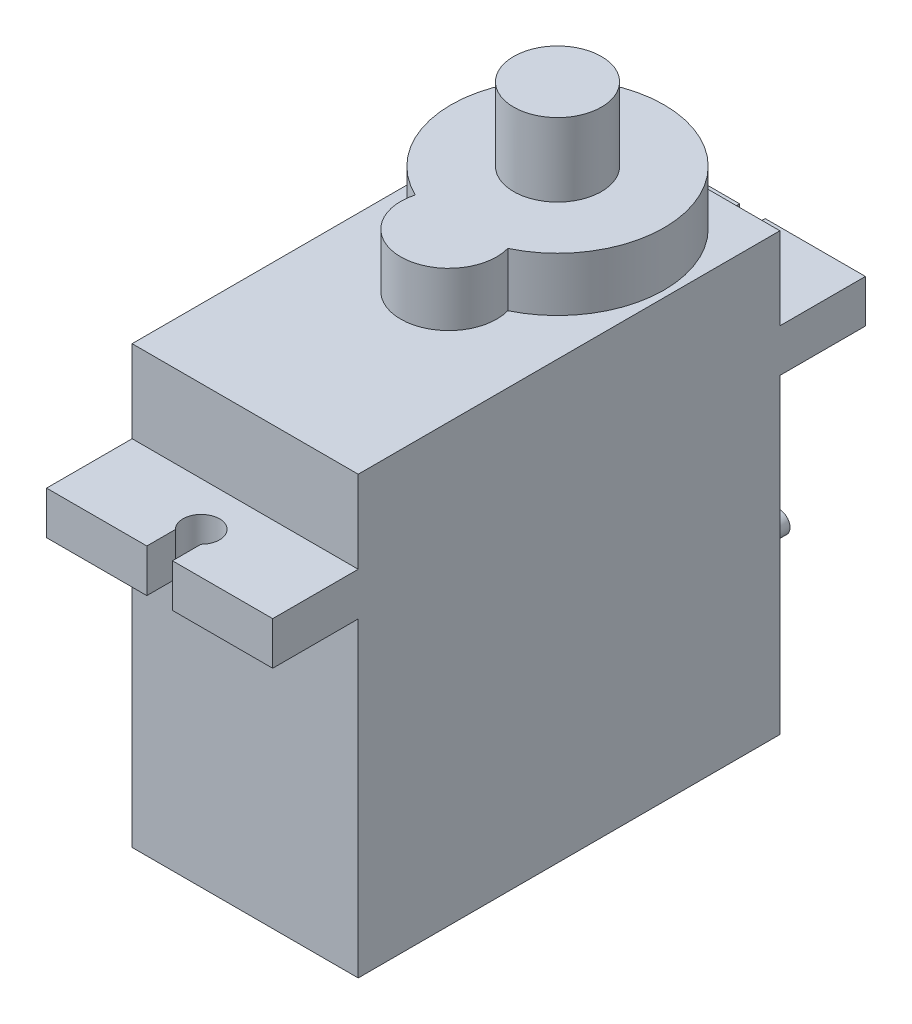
ISO-10303-21;
HEADER;
FILE_DESCRIPTION(('STEP AP214'),'2;1');
FILE_NAME('part.step','',(''),(''),'','','');
FILE_SCHEMA(('AUTOMOTIVE_DESIGN { 1 0 10303 214 1 1 1 1 }'));
ENDSEC;
DATA;
#1=APPLICATION_CONTEXT('core data for automotive mechanical design processes');
#2=APPLICATION_PROTOCOL_DEFINITION('international standard','automotive_design',2000,#1);
#3=PRODUCT_CONTEXT('',#1,'mechanical');
#4=PRODUCT('Part','Part','',(#3));
#5=PRODUCT_RELATED_PRODUCT_CATEGORY('part','',(#4));
#6=PRODUCT_DEFINITION_FORMATION('','',#4);
#7=PRODUCT_DEFINITION_CONTEXT('part definition',#1,'design');
#8=PRODUCT_DEFINITION('design','',#6,#7);
#9=PRODUCT_DEFINITION_SHAPE('','',#8);
#10=(LENGTH_UNIT() NAMED_UNIT(*) SI_UNIT(.MILLI.,.METRE.));
#11=(NAMED_UNIT(*) PLANE_ANGLE_UNIT() SI_UNIT($,.RADIAN.));
#12=(NAMED_UNIT(*) SI_UNIT($,.STERADIAN.) SOLID_ANGLE_UNIT());
#13=UNCERTAINTY_MEASURE_WITH_UNIT(LENGTH_MEASURE(1.E-05),#10,'distance_accuracy_value','');
#14=(GEOMETRIC_REPRESENTATION_CONTEXT(3) GLOBAL_UNCERTAINTY_ASSIGNED_CONTEXT((#13)) GLOBAL_UNIT_ASSIGNED_CONTEXT((#10,
#11,#12)) REPRESENTATION_CONTEXT('',''));
#15=CARTESIAN_POINT('',(0.,0.,0.));
#16=DIRECTION('',(0.,0.,1.));
#17=DIRECTION('',(1.,0.,0.));
#18=AXIS2_PLACEMENT_3D('',#15,#16,#17);
#19=CARTESIAN_POINT('',(0.,26.8,0.));
#20=DIRECTION('',(0.,-1.,0.));
#21=DIRECTION('',(0.,0.,-1.));
#22=AXIS2_PLACEMENT_3D('',#19,#20,#21);
#23=PLANE('',#22);
#24=CARTESIAN_POINT('',(0.,26.8,-17.075));
#25=DIRECTION('',(0.,-1.,0.));
#26=DIRECTION('',(0.,0.,-1.));
#27=AXIS2_PLACEMENT_3D('',#24,#25,#26);
#28=CIRCLE('',#27,5.825);
#29=CARTESIAN_POINT('',(-2.5291884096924,26.8,-11.827731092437));
#30=VERTEX_POINT('',#29);
#31=CARTESIAN_POINT('',(2.52918840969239,26.8,-11.827731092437));
#32=VERTEX_POINT('',#31);
#33=EDGE_CURVE('E191',#30,#32,#28,.T.);
#34=ORIENTED_EDGE('',*,*,#33,.F.);
#35=CARTESIAN_POINT('',(0.,26.8,-11.125));
#36=DIRECTION('',(0.,-1.,0.));
#37=DIRECTION('',(0.,0.,-1.));
#38=AXIS2_PLACEMENT_3D('',#35,#36,#37);
#39=CIRCLE('',#38,2.625);
#40=EDGE_CURVE('E208',#32,#30,#39,.T.);
#41=ORIENTED_EDGE('',*,*,#40,.F.);
#42=EDGE_LOOP('',(#34,#41));
#43=FACE_BOUND('',#42,.T.);
#44=CARTESIAN_POINT('',(0.,26.8,-17.075));
#45=DIRECTION('',(0.,-1.,0.));
#46=DIRECTION('',(0.,0.,-1.));
#47=AXIS2_PLACEMENT_3D('',#44,#45,#46);
#48=CIRCLE('',#47,2.4);
#49=CARTESIAN_POINT('',(0.,26.8,-19.475));
#50=VERTEX_POINT('',#49);
#51=EDGE_CURVE('E12',#50,#50,#48,.F.);
#52=ORIENTED_EDGE('',*,*,#51,.F.);
#53=EDGE_LOOP('',(#52));
#54=FACE_BOUND('',#53,.T.);
#55=ADVANCED_FACE('F39',(#43,#54),#23,.F.);
#56=CARTESIAN_POINT('',(0.,23.85,0.));
#57=DIRECTION('',(0.,1.,0.));
#58=DIRECTION('',(0.,0.,1.));
#59=AXIS2_PLACEMENT_3D('',#56,#57,#58);
#60=PLANE('',#59);
#61=DIRECTION('',(1.,0.,0.));
#62=VECTOR('',#61,1.);
#63=CARTESIAN_POINT('',(-6.17999999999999,23.85,0.));
#64=LINE('',#63,#62);
#65=CARTESIAN_POINT('',(-6.17999999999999,23.85,0.));
#66=VERTEX_POINT('',#65);
#67=CARTESIAN_POINT('',(6.18,23.85,0.));
#68=VERTEX_POINT('',#67);
#69=EDGE_CURVE('E209',#66,#68,#64,.T.);
#70=ORIENTED_EDGE('',*,*,#69,.T.);
#71=DIRECTION('',(0.,0.,-1.));
#72=VECTOR('',#71,1.);
#73=CARTESIAN_POINT('',(6.18,23.85,0.));
#74=LINE('',#73,#72);
#75=CARTESIAN_POINT('',(6.18,23.85,-23.05));
#76=VERTEX_POINT('',#75);
#77=EDGE_CURVE('E212',#68,#76,#74,.T.);
#78=ORIENTED_EDGE('',*,*,#77,.T.);
#79=DIRECTION('',(-1.,0.,0.));
#80=VECTOR('',#79,1.);
#81=CARTESIAN_POINT('',(6.18,23.85,-23.05));
#82=LINE('',#81,#80);
#83=CARTESIAN_POINT('',(-6.18000000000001,23.85,-23.05));
#84=VERTEX_POINT('',#83);
#85=EDGE_CURVE('E214',#76,#84,#82,.T.);
#86=ORIENTED_EDGE('',*,*,#85,.T.);
#87=DIRECTION('',(0.,0.,1.));
#88=VECTOR('',#87,1.);
#89=CARTESIAN_POINT('',(-6.18000000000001,23.85,-23.05));
#90=LINE('',#89,#88);
#91=EDGE_CURVE('E216',#84,#66,#90,.T.);
#92=ORIENTED_EDGE('',*,*,#91,.T.);
#93=EDGE_LOOP('',(#70,#78,#86,#92));
#94=FACE_BOUND('',#93,.T.);
#95=CARTESIAN_POINT('',(0.,23.85,-11.125));
#96=DIRECTION('',(0.,1.,0.));
#97=DIRECTION('',(0.,0.,1.));
#98=AXIS2_PLACEMENT_3D('',#95,#96,#97);
#99=CIRCLE('',#98,2.625);
#100=CARTESIAN_POINT('',(-2.52918840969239,23.85,-11.827731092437));
#101=VERTEX_POINT('',#100);
#102=CARTESIAN_POINT('',(2.52918840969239,23.85,-11.827731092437));
#103=VERTEX_POINT('',#102);
#104=EDGE_CURVE('E197',#101,#103,#99,.T.);
#105=ORIENTED_EDGE('',*,*,#104,.F.);
#106=CARTESIAN_POINT('',(0.,23.85,-17.075));
#107=DIRECTION('',(0.,1.,0.));
#108=DIRECTION('',(0.,0.,1.));
#109=AXIS2_PLACEMENT_3D('',#106,#107,#108);
#110=CIRCLE('',#109,5.825);
#111=EDGE_CURVE('E54',#103,#101,#110,.T.);
#112=ORIENTED_EDGE('',*,*,#111,.F.);
#113=EDGE_LOOP('',(#105,#112));
#114=FACE_BOUND('',#113,.T.);
#115=ADVANCED_FACE('F202',(#94,#114),#60,.T.);
#116=CARTESIAN_POINT('',(0.,19.35,0.));
#117=DIRECTION('',(0.,1.,0.));
#118=DIRECTION('',(0.,0.,1.));
#119=AXIS2_PLACEMENT_3D('',#116,#117,#118);
#120=PLANE('',#119);
#121=DIRECTION('',(1.,0.,0.));
#122=VECTOR('',#121,1.);
#123=CARTESIAN_POINT('',(-6.17999999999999,19.35,0.));
#124=LINE('',#123,#122);
#125=CARTESIAN_POINT('',(-6.18,19.35,0.));
#126=VERTEX_POINT('',#125);
#127=CARTESIAN_POINT('',(6.18,19.35,0.));
#128=VERTEX_POINT('',#127);
#129=EDGE_CURVE('E224',#126,#128,#124,.T.);
#130=ORIENTED_EDGE('',*,*,#129,.F.);
#131=DIRECTION('',(0.,0.,1.));
#132=VECTOR('',#131,1.);
#133=CARTESIAN_POINT('',(-6.18,19.35,-27.725));
#134=LINE('',#133,#132);
#135=CARTESIAN_POINT('',(-6.18,19.35,4.675));
#136=VERTEX_POINT('',#135);
#137=EDGE_CURVE('E318',#126,#136,#134,.T.);
#138=ORIENTED_EDGE('',*,*,#137,.T.);
#139=DIRECTION('',(1.,0.,0.));
#140=VECTOR('',#139,1.);
#141=CARTESIAN_POINT('',(-6.18,19.35,4.675));
#142=LINE('',#141,#140);
#143=CARTESIAN_POINT('',(-0.699999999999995,19.35,4.675));
#144=VERTEX_POINT('',#143);
#145=EDGE_CURVE('E314',#136,#144,#142,.T.);
#146=ORIENTED_EDGE('',*,*,#145,.T.);
#147=DIRECTION('',(0.,0.,1.));
#148=VECTOR('',#147,1.);
#149=CARTESIAN_POINT('',(-0.699999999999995,19.35,4.675));
#150=LINE('',#149,#148);
#151=CARTESIAN_POINT('',(-0.699999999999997,19.35,3.11414284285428));
#152=VERTEX_POINT('',#151);
#153=EDGE_CURVE('E285',#152,#144,#150,.T.);
#154=ORIENTED_EDGE('',*,*,#153,.F.);
#155=CARTESIAN_POINT('',(0.,19.35,2.4));
#156=DIRECTION('',(0.,1.,0.));
#157=DIRECTION('',(0.,0.,-1.));
#158=AXIS2_PLACEMENT_3D('',#155,#156,#157);
#159=CIRCLE('',#158,0.999999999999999);
#160=CARTESIAN_POINT('',(0.700000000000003,19.35,3.11414284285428));
#161=VERTEX_POINT('',#160);
#162=EDGE_CURVE('E290',#161,#152,#159,.T.);
#163=ORIENTED_EDGE('',*,*,#162,.F.);
#164=DIRECTION('',(0.,0.,-1.));
#165=VECTOR('',#164,1.);
#166=CARTESIAN_POINT('',(0.700000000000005,19.35,4.675));
#167=LINE('',#166,#165);
#168=CARTESIAN_POINT('',(0.700000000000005,19.35,4.675));
#169=VERTEX_POINT('',#168);
#170=EDGE_CURVE('E287',#169,#161,#167,.T.);
#171=ORIENTED_EDGE('',*,*,#170,.F.);
#172=CARTESIAN_POINT('',(6.18,19.35,4.675));
#173=VERTEX_POINT('',#172);
#174=EDGE_CURVE('E323',#169,#173,#142,.T.);
#175=ORIENTED_EDGE('',*,*,#174,.T.);
#176=DIRECTION('',(0.,0.,-1.));
#177=VECTOR('',#176,1.);
#178=CARTESIAN_POINT('',(6.18,19.35,-27.725));
#179=LINE('',#178,#177);
#180=EDGE_CURVE('E444',#173,#128,#179,.T.);
#181=ORIENTED_EDGE('',*,*,#180,.T.);
#182=EDGE_LOOP('',(#130,#138,#146,#154,#163,#171,#175,#181));
#183=FACE_BOUND('',#182,.T.);
#184=ADVANCED_FACE('F421',(#183),#120,.T.);
#185=CARTESIAN_POINT('',(-6.18,19.35,-27.725));
#186=DIRECTION('',(0.,0.,1.));
#187=DIRECTION('',(1.,0.,0.));
#188=AXIS2_PLACEMENT_3D('',#185,#186,#187);
#189=PLANE('',#188);
#190=DIRECTION('',(-1.,0.,0.));
#191=VECTOR('',#190,1.);
#192=CARTESIAN_POINT('',(-6.18,19.35,-27.725));
#193=LINE('',#192,#191);
#194=CARTESIAN_POINT('',(-0.7,19.35,-27.725));
#195=VERTEX_POINT('',#194);
#196=CARTESIAN_POINT('',(-6.18,19.35,-27.725));
#197=VERTEX_POINT('',#196);
#198=EDGE_CURVE('E445',#195,#197,#193,.T.);
#199=ORIENTED_EDGE('',*,*,#198,.F.);
#200=DIRECTION('',(0.,1.,0.));
#201=VECTOR('',#200,1.);
#202=CARTESIAN_POINT('',(-0.7,-2.50000000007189E-05,-27.725));
#203=LINE('',#202,#201);
#204=CARTESIAN_POINT('',(-0.7,17.,-27.725));
#205=VERTEX_POINT('',#204);
#206=EDGE_CURVE('E268',#205,#195,#203,.T.);
#207=ORIENTED_EDGE('',*,*,#206,.F.);
#208=DIRECTION('',(-1.,0.,0.));
#209=VECTOR('',#208,1.);
#210=CARTESIAN_POINT('',(-6.18,17.,-27.725));
#211=LINE('',#210,#209);
#212=CARTESIAN_POINT('',(-6.18,17.,-27.725));
#213=VERTEX_POINT('',#212);
#214=EDGE_CURVE('E402',#205,#213,#211,.T.);
#215=ORIENTED_EDGE('',*,*,#214,.T.);
#216=DIRECTION('',(0.,-1.,0.));
#217=VECTOR('',#216,1.);
#218=CARTESIAN_POINT('',(-6.18,19.35,-27.725));
#219=LINE('',#218,#217);
#220=EDGE_CURVE('E415',#197,#213,#219,.T.);
#221=ORIENTED_EDGE('',*,*,#220,.F.);
#222=EDGE_LOOP('',(#199,#207,#215,#221));
#223=FACE_BOUND('',#222,.T.);
#224=ADVANCED_FACE('F576',(#223),#189,.F.);
#225=CARTESIAN_POINT('',(-6.18,19.35,4.675));
#226=DIRECTION('',(0.,0.,-1.));
#227=DIRECTION('',(-1.,0.,0.));
#228=AXIS2_PLACEMENT_3D('',#225,#226,#227);
#229=PLANE('',#228);
#230=DIRECTION('',(1.,0.,0.));
#231=VECTOR('',#230,1.);
#232=CARTESIAN_POINT('',(-6.18,17.,4.675));
#233=LINE('',#232,#231);
#234=CARTESIAN_POINT('',(-6.18,17.,4.675));
#235=VERTEX_POINT('',#234);
#236=CARTESIAN_POINT('',(-0.699999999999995,17.,4.675));
#237=VERTEX_POINT('',#236);
#238=EDGE_CURVE('E393',#235,#237,#233,.T.);
#239=ORIENTED_EDGE('',*,*,#238,.T.);
#240=DIRECTION('',(0.,1.,0.));
#241=VECTOR('',#240,1.);
#242=CARTESIAN_POINT('',(-0.699999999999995,-2.50000000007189E-05,4.675));
#243=LINE('',#242,#241);
#244=EDGE_CURVE('E293',#237,#144,#243,.T.);
#245=ORIENTED_EDGE('',*,*,#244,.T.);
#246=ORIENTED_EDGE('',*,*,#145,.F.);
#247=DIRECTION('',(0.,-1.,0.));
#248=VECTOR('',#247,1.);
#249=CARTESIAN_POINT('',(-6.18,19.35,4.675));
#250=LINE('',#249,#248);
#251=EDGE_CURVE('E371',#136,#235,#250,.T.);
#252=ORIENTED_EDGE('',*,*,#251,.T.);
#253=EDGE_LOOP('',(#239,#245,#246,#252));
#254=FACE_BOUND('',#253,.T.);
#255=ADVANCED_FACE('F423',(#254),#229,.F.);
#256=CARTESIAN_POINT('',(-6.17999999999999,17.,0.));
#257=DIRECTION('',(1.,0.,0.));
#258=DIRECTION('',(0.,0.,-1.));
#259=AXIS2_PLACEMENT_3D('',#256,#257,#258);
#260=PLANE('',#259);
#261=DIRECTION('',(0.,0.,1.));
#262=VECTOR('',#261,1.);
#263=CARTESIAN_POINT('',(-6.17999999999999,0.,0.));
#264=LINE('',#263,#262);
#265=CARTESIAN_POINT('',(-6.18000000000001,0.,-23.05));
#266=VERTEX_POINT('',#265);
#267=CARTESIAN_POINT('',(-6.17999999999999,0.,0.));
#268=VERTEX_POINT('',#267);
#269=EDGE_CURVE('E350',#266,#268,#264,.T.);
#270=ORIENTED_EDGE('',*,*,#269,.T.);
#271=DIRECTION('',(0.,-1.,0.));
#272=VECTOR('',#271,1.);
#273=CARTESIAN_POINT('',(-6.17999999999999,17.,0.));
#274=LINE('',#273,#272);
#275=CARTESIAN_POINT('',(-6.17999999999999,17.,0.));
#276=VERTEX_POINT('',#275);
#277=EDGE_CURVE('E47',#276,#268,#274,.T.);
#278=ORIENTED_EDGE('',*,*,#277,.F.);
#279=DIRECTION('',(0.,0.,1.));
#280=VECTOR('',#279,1.);
#281=CARTESIAN_POINT('',(-6.18,17.,-27.725));
#282=LINE('',#281,#280);
#283=EDGE_CURVE('E311',#276,#235,#282,.T.);
#284=ORIENTED_EDGE('',*,*,#283,.T.);
#285=ORIENTED_EDGE('',*,*,#251,.F.);
#286=ORIENTED_EDGE('',*,*,#137,.F.);
#287=DIRECTION('',(0.,-1.,0.));
#288=VECTOR('',#287,1.);
#289=CARTESIAN_POINT('',(-6.17999999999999,23.85,0.));
#290=LINE('',#289,#288);
#291=EDGE_CURVE('E218',#66,#126,#290,.T.);
#292=ORIENTED_EDGE('',*,*,#291,.F.);
#293=ORIENTED_EDGE('',*,*,#91,.F.);
#294=DIRECTION('',(0.,-1.,0.));
#295=VECTOR('',#294,1.);
#296=CARTESIAN_POINT('',(-6.18000000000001,23.85,-23.05));
#297=LINE('',#296,#295);
#298=CARTESIAN_POINT('',(-6.18000000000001,19.35,-23.05));
#299=VERTEX_POINT('',#298);
#300=EDGE_CURVE('E231',#84,#299,#297,.T.);
#301=ORIENTED_EDGE('',*,*,#300,.T.);
#302=EDGE_CURVE('E321',#197,#299,#134,.T.);
#303=ORIENTED_EDGE('',*,*,#302,.F.);
#304=ORIENTED_EDGE('',*,*,#220,.T.);
#305=CARTESIAN_POINT('',(-6.18,17.,-23.05));
#306=VERTEX_POINT('',#305);
#307=EDGE_CURVE('E385',#213,#306,#282,.T.);
#308=ORIENTED_EDGE('',*,*,#307,.T.);
#309=DIRECTION('',(0.,-1.,0.));
#310=VECTOR('',#309,1.);
#311=CARTESIAN_POINT('',(-6.18000000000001,17.,-23.05));
#312=LINE('',#311,#310);
#313=EDGE_CURVE('E355',#306,#266,#312,.T.);
#314=ORIENTED_EDGE('',*,*,#313,.T.);
#315=EDGE_LOOP('',(#270,#278,#284,#285,#286,#292,#293,#301,#303,#304,#308,#314));
#316=FACE_BOUND('',#315,.T.);
#317=ADVANCED_FACE('F41',(#316),#260,.F.);
#318=CARTESIAN_POINT('',(-6.17999999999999,17.,0.));
#319=DIRECTION('',(0.,0.,-1.));
#320=DIRECTION('',(-1.,0.,0.));
#321=AXIS2_PLACEMENT_3D('',#318,#319,#320);
#322=PLANE('',#321);
#323=DIRECTION('',(1.,0.,0.));
#324=VECTOR('',#323,1.);
#325=CARTESIAN_POINT('',(-6.17999999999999,0.,0.));
#326=LINE('',#325,#324);
#327=CARTESIAN_POINT('',(6.18,0.,0.));
#328=VERTEX_POINT('',#327);
#329=EDGE_CURVE('E369',#268,#328,#326,.T.);
#330=ORIENTED_EDGE('',*,*,#329,.T.);
#331=DIRECTION('',(0.,-1.,0.));
#332=VECTOR('',#331,1.);
#333=CARTESIAN_POINT('',(6.18,17.,0.));
#334=LINE('',#333,#332);
#335=CARTESIAN_POINT('',(6.18,17.,0.));
#336=VERTEX_POINT('',#335);
#337=EDGE_CURVE('E328',#336,#328,#334,.T.);
#338=ORIENTED_EDGE('',*,*,#337,.F.);
#339=DIRECTION('',(1.,0.,0.));
#340=VECTOR('',#339,1.);
#341=CARTESIAN_POINT('',(-6.17999999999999,17.,0.));
#342=LINE('',#341,#340);
#343=EDGE_CURVE('E334',#276,#336,#342,.T.);
#344=ORIENTED_EDGE('',*,*,#343,.F.);
#345=ORIENTED_EDGE('',*,*,#277,.T.);
#346=EDGE_LOOP('',(#330,#338,#344,#345));
#347=FACE_BOUND('',#346,.T.);
#348=ADVANCED_FACE('F556',(#347),#322,.F.);
#349=CARTESIAN_POINT('',(6.18,17.,0.));
#350=DIRECTION('',(-1.,0.,0.));
#351=DIRECTION('',(0.,0.,1.));
#352=AXIS2_PLACEMENT_3D('',#349,#350,#351);
#353=PLANE('',#352);
#354=DIRECTION('',(0.,0.,-1.));
#355=VECTOR('',#354,1.);
#356=CARTESIAN_POINT('',(6.18,0.,0.));
#357=LINE('',#356,#355);
#358=CARTESIAN_POINT('',(6.18,0.,-23.05));
#359=VERTEX_POINT('',#358);
#360=EDGE_CURVE('E368',#328,#359,#357,.T.);
#361=ORIENTED_EDGE('',*,*,#360,.T.);
#362=DIRECTION('',(0.,-1.,0.));
#363=VECTOR('',#362,1.);
#364=CARTESIAN_POINT('',(6.18,17.,-23.05));
#365=LINE('',#364,#363);
#366=CARTESIAN_POINT('',(6.18,17.,-23.05));
#367=VERTEX_POINT('',#366);
#368=EDGE_CURVE('E333',#367,#359,#365,.T.);
#369=ORIENTED_EDGE('',*,*,#368,.F.);
#370=DIRECTION('',(0.,0.,-1.));
#371=VECTOR('',#370,1.);
#372=CARTESIAN_POINT('',(6.18,17.,-27.725));
#373=LINE('',#372,#371);
#374=CARTESIAN_POINT('',(6.18,17.,-27.725));
#375=VERTEX_POINT('',#374);
#376=EDGE_CURVE('E345',#367,#375,#373,.T.);
#377=ORIENTED_EDGE('',*,*,#376,.T.);
#378=DIRECTION('',(0.,-1.,0.));
#379=VECTOR('',#378,1.);
#380=CARTESIAN_POINT('',(6.18,19.35,-27.725));
#381=LINE('',#380,#379);
#382=CARTESIAN_POINT('',(6.18,19.35,-27.725));
#383=VERTEX_POINT('',#382);
#384=EDGE_CURVE('E381',#383,#375,#381,.T.);
#385=ORIENTED_EDGE('',*,*,#384,.F.);
#386=CARTESIAN_POINT('',(6.18,19.35,-23.05));
#387=VERTEX_POINT('',#386);
#388=EDGE_CURVE('E424',#387,#383,#179,.T.);
#389=ORIENTED_EDGE('',*,*,#388,.F.);
#390=DIRECTION('',(0.,-1.,0.));
#391=VECTOR('',#390,1.);
#392=CARTESIAN_POINT('',(6.18,23.85,-23.05));
#393=LINE('',#392,#391);
#394=EDGE_CURVE('E237',#76,#387,#393,.T.);
#395=ORIENTED_EDGE('',*,*,#394,.F.);
#396=ORIENTED_EDGE('',*,*,#77,.F.);
#397=DIRECTION('',(0.,-1.,0.));
#398=VECTOR('',#397,1.);
#399=CARTESIAN_POINT('',(6.18,23.85,0.));
#400=LINE('',#399,#398);
#401=EDGE_CURVE('E244',#68,#128,#400,.T.);
#402=ORIENTED_EDGE('',*,*,#401,.T.);
#403=ORIENTED_EDGE('',*,*,#180,.F.);
#404=DIRECTION('',(0.,-1.,0.));
#405=VECTOR('',#404,1.);
#406=CARTESIAN_POINT('',(6.18,19.35,4.675));
#407=LINE('',#406,#405);
#408=CARTESIAN_POINT('',(6.18,17.,4.675));
#409=VERTEX_POINT('',#408);
#410=EDGE_CURVE('E374',#173,#409,#407,.T.);
#411=ORIENTED_EDGE('',*,*,#410,.T.);
#412=EDGE_CURVE('E400',#409,#336,#373,.T.);
#413=ORIENTED_EDGE('',*,*,#412,.T.);
#414=ORIENTED_EDGE('',*,*,#337,.T.);
#415=EDGE_LOOP('',(#361,#369,#377,#385,#389,#395,#396,#402,#403,#411,#413,#414));
#416=FACE_BOUND('',#415,.T.);
#417=ADVANCED_FACE('F407',(#416),#353,.F.);
#418=CARTESIAN_POINT('',(-6.18000000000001,17.,-23.05));
#419=DIRECTION('',(0.,0.,1.));
#420=DIRECTION('',(1.,0.,0.));
#421=AXIS2_PLACEMENT_3D('',#418,#419,#420);
#422=PLANE('',#421);
#423=CARTESIAN_POINT('',(1.16,5.075,-23.05));
#424=DIRECTION('',(0.,0.,1.));
#425=DIRECTION('',(1.,0.,0.));
#426=AXIS2_PLACEMENT_3D('',#423,#424,#425);
#427=CIRCLE('',#426,0.575);
#428=CARTESIAN_POINT('',(1.735,5.075,-23.05));
#429=VERTEX_POINT('',#428);
#430=EDGE_CURVE('E512',#429,#429,#427,.T.);
#431=ORIENTED_EDGE('',*,*,#430,.T.);
#432=EDGE_LOOP('',(#431));
#433=FACE_BOUND('',#432,.T.);
#434=CARTESIAN_POINT('',(0.,5.075,-23.05));
#435=DIRECTION('',(0.,0.,1.));
#436=DIRECTION('',(1.,0.,0.));
#437=AXIS2_PLACEMENT_3D('',#434,#435,#436);
#438=CIRCLE('',#437,0.575);
#439=CARTESIAN_POINT('',(0.575,5.075,-23.05));
#440=VERTEX_POINT('',#439);
#441=EDGE_CURVE('E506',#440,#440,#438,.T.);
#442=ORIENTED_EDGE('',*,*,#441,.T.);
#443=EDGE_LOOP('',(#442));
#444=FACE_BOUND('',#443,.T.);
#445=CARTESIAN_POINT('',(-1.16,5.075,-23.05));
#446=DIRECTION('',(0.,0.,1.));
#447=DIRECTION('',(1.,0.,0.));
#448=AXIS2_PLACEMENT_3D('',#445,#446,#447);
#449=CIRCLE('',#448,0.575);
#450=CARTESIAN_POINT('',(-0.585,5.075,-23.05));
#451=VERTEX_POINT('',#450);
#452=EDGE_CURVE('E500',#451,#451,#449,.T.);
#453=ORIENTED_EDGE('',*,*,#452,.T.);
#454=EDGE_LOOP('',(#453));
#455=FACE_BOUND('',#454,.T.);
#456=DIRECTION('',(-1.,0.,0.));
#457=VECTOR('',#456,1.);
#458=CARTESIAN_POINT('',(-6.18000000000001,0.,-23.05));
#459=LINE('',#458,#457);
#460=EDGE_CURVE('E339',#359,#266,#459,.T.);
#461=ORIENTED_EDGE('',*,*,#460,.T.);
#462=ORIENTED_EDGE('',*,*,#313,.F.);
#463=DIRECTION('',(-1.,0.,0.));
#464=VECTOR('',#463,1.);
#465=CARTESIAN_POINT('',(-6.18000000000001,17.,-23.05));
#466=LINE('',#465,#464);
#467=EDGE_CURVE('E338',#367,#306,#466,.T.);
#468=ORIENTED_EDGE('',*,*,#467,.F.);
#469=ORIENTED_EDGE('',*,*,#368,.T.);
#470=EDGE_LOOP('',(#461,#462,#468,#469));
#471=FACE_BOUND('',#470,.T.);
#472=ADVANCED_FACE('F549',(#433,#444,#455,#471),#422,.F.);
#473=CARTESIAN_POINT('',(0.,0.,0.));
#474=DIRECTION('',(0.,-1.,0.));
#475=DIRECTION('',(0.,0.,-1.));
#476=AXIS2_PLACEMENT_3D('',#473,#474,#475);
#477=PLANE('',#476);
#478=ORIENTED_EDGE('',*,*,#269,.F.);
#479=ORIENTED_EDGE('',*,*,#460,.F.);
#480=ORIENTED_EDGE('',*,*,#360,.F.);
#481=ORIENTED_EDGE('',*,*,#329,.F.);
#482=EDGE_LOOP('',(#478,#479,#480,#481));
#483=FACE_BOUND('',#482,.T.);
#484=ADVANCED_FACE('F551',(#483),#477,.T.);
#485=CARTESIAN_POINT('',(0.,17.,0.));
#486=DIRECTION('',(0.,1.,0.));
#487=DIRECTION('',(0.,0.,1.));
#488=AXIS2_PLACEMENT_3D('',#485,#486,#487);
#489=PLANE('',#488);
#490=CARTESIAN_POINT('',(0.,17.,2.4));
#491=DIRECTION('',(0.,1.,0.));
#492=DIRECTION('',(0.,0.,1.));
#493=AXIS2_PLACEMENT_3D('',#490,#491,#492);
#494=CIRCLE('',#493,0.999999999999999);
#495=CARTESIAN_POINT('',(0.700000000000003,17.,3.11414284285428));
#496=VERTEX_POINT('',#495);
#497=CARTESIAN_POINT('',(-0.699999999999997,17.,3.11414284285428));
#498=VERTEX_POINT('',#497);
#499=EDGE_CURVE('E305',#496,#498,#494,.T.);
#500=ORIENTED_EDGE('',*,*,#499,.T.);
#501=DIRECTION('',(0.,0.,1.));
#502=VECTOR('',#501,1.);
#503=CARTESIAN_POINT('',(-0.7,17.,0.));
#504=LINE('',#503,#502);
#505=EDGE_CURVE('E308',#498,#237,#504,.T.);
#506=ORIENTED_EDGE('',*,*,#505,.T.);
#507=ORIENTED_EDGE('',*,*,#238,.F.);
#508=ORIENTED_EDGE('',*,*,#283,.F.);
#509=ORIENTED_EDGE('',*,*,#343,.T.);
#510=ORIENTED_EDGE('',*,*,#412,.F.);
#511=CARTESIAN_POINT('',(0.700000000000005,17.,4.675));
#512=VERTEX_POINT('',#511);
#513=EDGE_CURVE('E388',#512,#409,#233,.T.);
#514=ORIENTED_EDGE('',*,*,#513,.F.);
#515=DIRECTION('',(0.,0.,-1.));
#516=VECTOR('',#515,1.);
#517=CARTESIAN_POINT('',(0.7,17.,0.));
#518=LINE('',#517,#516);
#519=EDGE_CURVE('E296',#512,#496,#518,.T.);
#520=ORIENTED_EDGE('',*,*,#519,.T.);
#521=EDGE_LOOP('',(#500,#506,#507,#508,#509,#510,#514,#520));
#522=FACE_BOUND('',#521,.T.);
#523=ADVANCED_FACE('F428',(#522),#489,.F.);
#524=ORIENTED_EDGE('',*,*,#214,.F.);
#525=DIRECTION('',(0.,0.,1.));
#526=VECTOR('',#525,1.);
#527=CARTESIAN_POINT('',(-0.699999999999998,17.,0.));
#528=LINE('',#527,#526);
#529=CARTESIAN_POINT('',(-0.7,17.,-26.1641428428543));
#530=VERTEX_POINT('',#529);
#531=EDGE_CURVE('E282',#205,#530,#528,.T.);
#532=ORIENTED_EDGE('',*,*,#531,.T.);
#533=CARTESIAN_POINT('',(0.,17.,-25.45));
#534=DIRECTION('',(0.,1.,0.));
#535=DIRECTION('',(0.,0.,1.));
#536=AXIS2_PLACEMENT_3D('',#533,#534,#535);
#537=CIRCLE('',#536,0.999999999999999);
#538=CARTESIAN_POINT('',(0.7,17.,-26.1641428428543));
#539=VERTEX_POINT('',#538);
#540=EDGE_CURVE('E270',#530,#539,#537,.T.);
#541=ORIENTED_EDGE('',*,*,#540,.T.);
#542=DIRECTION('',(0.,0.,-1.));
#543=VECTOR('',#542,1.);
#544=CARTESIAN_POINT('',(0.699999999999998,17.,0.));
#545=LINE('',#544,#543);
#546=CARTESIAN_POINT('',(0.7,17.,-27.725));
#547=VERTEX_POINT('',#546);
#548=EDGE_CURVE('E279',#539,#547,#545,.T.);
#549=ORIENTED_EDGE('',*,*,#548,.T.);
#550=EDGE_CURVE('E397',#375,#547,#211,.T.);
#551=ORIENTED_EDGE('',*,*,#550,.F.);
#552=ORIENTED_EDGE('',*,*,#376,.F.);
#553=ORIENTED_EDGE('',*,*,#467,.T.);
#554=ORIENTED_EDGE('',*,*,#307,.F.);
#555=EDGE_LOOP('',(#524,#532,#541,#549,#551,#552,#553,#554));
#556=FACE_BOUND('',#555,.T.);
#557=ADVANCED_FACE('F417',(#556),#489,.F.);
#558=ORIENTED_EDGE('',*,*,#174,.F.);
#559=DIRECTION('',(0.,1.,0.));
#560=VECTOR('',#559,1.);
#561=CARTESIAN_POINT('',(0.700000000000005,-2.50000000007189E-05,4.675));
#562=LINE('',#561,#560);
#563=EDGE_CURVE('E299',#512,#169,#562,.T.);
#564=ORIENTED_EDGE('',*,*,#563,.F.);
#565=ORIENTED_EDGE('',*,*,#513,.T.);
#566=ORIENTED_EDGE('',*,*,#410,.F.);
#567=EDGE_LOOP('',(#558,#564,#565,#566));
#568=FACE_BOUND('',#567,.T.);
#569=ADVANCED_FACE('F442',(#568),#229,.F.);
#570=ORIENTED_EDGE('',*,*,#550,.T.);
#571=DIRECTION('',(0.,1.,0.));
#572=VECTOR('',#571,1.);
#573=CARTESIAN_POINT('',(0.7,-2.50000000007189E-05,-27.725));
#574=LINE('',#573,#572);
#575=CARTESIAN_POINT('',(0.7,19.35,-27.725));
#576=VERTEX_POINT('',#575);
#577=EDGE_CURVE('E271',#547,#576,#574,.T.);
#578=ORIENTED_EDGE('',*,*,#577,.T.);
#579=EDGE_CURVE('E392',#383,#576,#193,.T.);
#580=ORIENTED_EDGE('',*,*,#579,.F.);
#581=ORIENTED_EDGE('',*,*,#384,.T.);
#582=EDGE_LOOP('',(#570,#578,#580,#581));
#583=FACE_BOUND('',#582,.T.);
#584=ADVANCED_FACE('F413',(#583),#189,.F.);
#585=DIRECTION('',(-1.,0.,0.));
#586=VECTOR('',#585,1.);
#587=CARTESIAN_POINT('',(6.18,19.35,-23.05));
#588=LINE('',#587,#586);
#589=EDGE_CURVE('E62',#387,#299,#588,.T.);
#590=ORIENTED_EDGE('',*,*,#589,.F.);
#591=ORIENTED_EDGE('',*,*,#388,.T.);
#592=ORIENTED_EDGE('',*,*,#579,.T.);
#593=DIRECTION('',(0.,0.,-1.));
#594=VECTOR('',#593,1.);
#595=CARTESIAN_POINT('',(0.7,19.35,-27.725));
#596=LINE('',#595,#594);
#597=CARTESIAN_POINT('',(0.7,19.35,-26.1641428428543));
#598=VERTEX_POINT('',#597);
#599=EDGE_CURVE('E263',#598,#576,#596,.T.);
#600=ORIENTED_EDGE('',*,*,#599,.F.);
#601=CARTESIAN_POINT('',(0.,19.35,-25.45));
#602=DIRECTION('',(0.,1.,0.));
#603=DIRECTION('',(0.,0.,1.));
#604=AXIS2_PLACEMENT_3D('',#601,#602,#603);
#605=CIRCLE('',#604,0.999999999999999);
#606=CARTESIAN_POINT('',(-0.7,19.35,-26.1641428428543));
#607=VERTEX_POINT('',#606);
#608=EDGE_CURVE('E257',#607,#598,#605,.T.);
#609=ORIENTED_EDGE('',*,*,#608,.F.);
#610=DIRECTION('',(0.,0.,1.));
#611=VECTOR('',#610,1.);
#612=CARTESIAN_POINT('',(-0.7,19.35,-27.725));
#613=LINE('',#612,#611);
#614=EDGE_CURVE('E253',#195,#607,#613,.T.);
#615=ORIENTED_EDGE('',*,*,#614,.F.);
#616=ORIENTED_EDGE('',*,*,#198,.T.);
#617=ORIENTED_EDGE('',*,*,#302,.T.);
#618=EDGE_LOOP('',(#590,#591,#592,#600,#609,#615,#616,#617));
#619=FACE_BOUND('',#618,.T.);
#620=ADVANCED_FACE('F448',(#619),#120,.T.);
#621=CARTESIAN_POINT('',(-0.699999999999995,-2.50000000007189E-05,4.675));
#622=DIRECTION('',(-1.,0.,0.));
#623=DIRECTION('',(0.,0.,1.));
#624=AXIS2_PLACEMENT_3D('',#621,#622,#623);
#625=PLANE('',#624);
#626=DIRECTION('',(0.,1.,0.));
#627=VECTOR('',#626,1.);
#628=CARTESIAN_POINT('',(-0.699999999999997,-2.50000000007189E-05,3.11414284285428));
#629=LINE('',#628,#627);
#630=EDGE_CURVE('E294',#498,#152,#629,.T.);
#631=ORIENTED_EDGE('',*,*,#630,.T.);
#632=ORIENTED_EDGE('',*,*,#153,.T.);
#633=ORIENTED_EDGE('',*,*,#244,.F.);
#634=ORIENTED_EDGE('',*,*,#505,.F.);
#635=EDGE_LOOP('',(#631,#632,#633,#634));
#636=FACE_BOUND('',#635,.T.);
#637=ADVANCED_FACE('F431',(#636),#625,.F.);
#638=CARTESIAN_POINT('',(0.,-2.50000000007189E-05,2.4));
#639=DIRECTION('',(0.,1.,0.));
#640=DIRECTION('',(0.,0.,1.));
#641=AXIS2_PLACEMENT_3D('',#638,#639,#640);
#642=CYLINDRICAL_SURFACE('',#641,0.999999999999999);
#643=DIRECTION('',(0.,1.,0.));
#644=VECTOR('',#643,1.);
#645=CARTESIAN_POINT('',(0.700000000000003,-2.50000000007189E-05,3.11414284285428));
#646=LINE('',#645,#644);
#647=EDGE_CURVE('E297',#496,#161,#646,.T.);
#648=ORIENTED_EDGE('',*,*,#647,.T.);
#649=ORIENTED_EDGE('',*,*,#162,.T.);
#650=ORIENTED_EDGE('',*,*,#630,.F.);
#651=ORIENTED_EDGE('',*,*,#499,.F.);
#652=EDGE_LOOP('',(#648,#649,#650,#651));
#653=FACE_BOUND('',#652,.T.);
#654=ADVANCED_FACE('F433',(#653),#642,.F.);
#655=CARTESIAN_POINT('',(0.700000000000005,-2.50000000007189E-05,4.675));
#656=DIRECTION('',(1.,0.,0.));
#657=DIRECTION('',(0.,0.,-1.));
#658=AXIS2_PLACEMENT_3D('',#655,#656,#657);
#659=PLANE('',#658);
#660=ORIENTED_EDGE('',*,*,#563,.T.);
#661=ORIENTED_EDGE('',*,*,#170,.T.);
#662=ORIENTED_EDGE('',*,*,#647,.F.);
#663=ORIENTED_EDGE('',*,*,#519,.F.);
#664=EDGE_LOOP('',(#660,#661,#662,#663));
#665=FACE_BOUND('',#664,.T.);
#666=ADVANCED_FACE('F557',(#665),#659,.F.);
#667=CARTESIAN_POINT('',(-0.7,-2.50000000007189E-05,-27.725));
#668=DIRECTION('',(-1.,0.,0.));
#669=DIRECTION('',(0.,0.,1.));
#670=AXIS2_PLACEMENT_3D('',#667,#668,#669);
#671=PLANE('',#670);
#672=ORIENTED_EDGE('',*,*,#206,.T.);
#673=ORIENTED_EDGE('',*,*,#614,.T.);
#674=DIRECTION('',(0.,1.,0.));
#675=VECTOR('',#674,1.);
#676=CARTESIAN_POINT('',(-0.7,-2.50000000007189E-05,-26.1641428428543));
#677=LINE('',#676,#675);
#678=EDGE_CURVE('E267',#530,#607,#677,.T.);
#679=ORIENTED_EDGE('',*,*,#678,.F.);
#680=ORIENTED_EDGE('',*,*,#531,.F.);
#681=EDGE_LOOP('',(#672,#673,#679,#680));
#682=FACE_BOUND('',#681,.T.);
#683=ADVANCED_FACE('F559',(#682),#671,.F.);
#684=CARTESIAN_POINT('',(0.7,-2.50000000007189E-05,-27.725));
#685=DIRECTION('',(1.,0.,0.));
#686=DIRECTION('',(0.,0.,-1.));
#687=AXIS2_PLACEMENT_3D('',#684,#685,#686);
#688=PLANE('',#687);
#689=DIRECTION('',(0.,1.,0.));
#690=VECTOR('',#689,1.);
#691=CARTESIAN_POINT('',(0.7,-2.50000000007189E-05,-26.1641428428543));
#692=LINE('',#691,#690);
#693=EDGE_CURVE('E274',#539,#598,#692,.T.);
#694=ORIENTED_EDGE('',*,*,#693,.T.);
#695=ORIENTED_EDGE('',*,*,#599,.T.);
#696=ORIENTED_EDGE('',*,*,#577,.F.);
#697=ORIENTED_EDGE('',*,*,#548,.F.);
#698=EDGE_LOOP('',(#694,#695,#696,#697));
#699=FACE_BOUND('',#698,.T.);
#700=ADVANCED_FACE('F464',(#699),#688,.F.);
#701=CARTESIAN_POINT('',(0.,-2.50000000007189E-05,-25.45));
#702=DIRECTION('',(0.,1.,0.));
#703=DIRECTION('',(0.,0.,1.));
#704=AXIS2_PLACEMENT_3D('',#701,#702,#703);
#705=CYLINDRICAL_SURFACE('',#704,0.999999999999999);
#706=ORIENTED_EDGE('',*,*,#678,.T.);
#707=ORIENTED_EDGE('',*,*,#608,.T.);
#708=ORIENTED_EDGE('',*,*,#693,.F.);
#709=ORIENTED_EDGE('',*,*,#540,.F.);
#710=EDGE_LOOP('',(#706,#707,#708,#709));
#711=FACE_BOUND('',#710,.T.);
#712=ADVANCED_FACE('F457',(#711),#705,.F.);
#713=CARTESIAN_POINT('',(-6.17999999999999,23.85,0.));
#714=DIRECTION('',(0.,0.,-1.));
#715=DIRECTION('',(-1.,0.,0.));
#716=AXIS2_PLACEMENT_3D('',#713,#714,#715);
#717=PLANE('',#716);
#718=ORIENTED_EDGE('',*,*,#129,.T.);
#719=ORIENTED_EDGE('',*,*,#401,.F.);
#720=ORIENTED_EDGE('',*,*,#69,.F.);
#721=ORIENTED_EDGE('',*,*,#291,.T.);
#722=EDGE_LOOP('',(#718,#719,#720,#721));
#723=FACE_BOUND('',#722,.T.);
#724=ADVANCED_FACE('F455',(#723),#717,.F.);
#725=CARTESIAN_POINT('',(6.18,23.85,-23.05));
#726=DIRECTION('',(0.,0.,1.));
#727=DIRECTION('',(1.,0.,0.));
#728=AXIS2_PLACEMENT_3D('',#725,#726,#727);
#729=PLANE('',#728);
#730=ORIENTED_EDGE('',*,*,#589,.T.);
#731=ORIENTED_EDGE('',*,*,#300,.F.);
#732=ORIENTED_EDGE('',*,*,#85,.F.);
#733=ORIENTED_EDGE('',*,*,#394,.T.);
#734=EDGE_LOOP('',(#730,#731,#732,#733));
#735=FACE_BOUND('',#734,.T.);
#736=ADVANCED_FACE('F453',(#735),#729,.F.);
#737=CARTESIAN_POINT('',(0.,72.1224863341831,-17.075));
#738=DIRECTION('',(0.,-1.,0.));
#739=DIRECTION('',(0.,0.,-1.));
#740=AXIS2_PLACEMENT_3D('',#737,#738,#739);
#741=CYLINDRICAL_SURFACE('',#740,5.825);
#742=DIRECTION('',(0.,-1.,0.));
#743=VECTOR('',#742,1.);
#744=CARTESIAN_POINT('',(-2.52918840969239,72.1224863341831,-11.827731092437));
#745=LINE('',#744,#743);
#746=EDGE_CURVE('E194',#30,#101,#745,.T.);
#747=ORIENTED_EDGE('',*,*,#746,.F.);
#748=ORIENTED_EDGE('',*,*,#33,.T.);
#749=DIRECTION('',(0.,-1.,0.));
#750=VECTOR('',#749,1.);
#751=CARTESIAN_POINT('',(2.52918840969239,72.1224863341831,-11.827731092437));
#752=LINE('',#751,#750);
#753=EDGE_CURVE('E188',#32,#103,#752,.T.);
#754=ORIENTED_EDGE('',*,*,#753,.T.);
#755=ORIENTED_EDGE('',*,*,#111,.T.);
#756=EDGE_LOOP('',(#747,#748,#754,#755));
#757=FACE_BOUND('',#756,.T.);
#758=ADVANCED_FACE('F190',(#757),#741,.T.);
#759=CARTESIAN_POINT('',(0.,72.1224863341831,-11.125));
#760=DIRECTION('',(0.,-1.,0.));
#761=DIRECTION('',(0.,0.,-1.));
#762=AXIS2_PLACEMENT_3D('',#759,#760,#761);
#763=CYLINDRICAL_SURFACE('',#762,2.625);
#764=ORIENTED_EDGE('',*,*,#753,.F.);
#765=ORIENTED_EDGE('',*,*,#40,.T.);
#766=ORIENTED_EDGE('',*,*,#746,.T.);
#767=ORIENTED_EDGE('',*,*,#104,.T.);
#768=EDGE_LOOP('',(#764,#765,#766,#767));
#769=FACE_BOUND('',#768,.T.);
#770=ADVANCED_FACE('F198',(#769),#763,.T.);
#771=CARTESIAN_POINT('',(0.,30.8,-17.075));
#772=DIRECTION('',(0.,-1.,0.));
#773=DIRECTION('',(0.,0.,-1.));
#774=AXIS2_PLACEMENT_3D('',#771,#772,#773);
#775=CYLINDRICAL_SURFACE('',#774,2.4);
#776=CARTESIAN_POINT('',(0.,30.8,-17.075));
#777=DIRECTION('',(0.,1.,0.));
#778=DIRECTION('',(0.,0.,1.));
#779=AXIS2_PLACEMENT_3D('',#776,#777,#778);
#780=CIRCLE('',#779,2.4);
#781=CARTESIAN_POINT('',(0.,30.8,-14.675));
#782=VERTEX_POINT('',#781);
#783=EDGE_CURVE('E200',#782,#782,#780,.T.);
#784=ORIENTED_EDGE('',*,*,#783,.F.);
#785=EDGE_LOOP('',(#784));
#786=FACE_BOUND('',#785,.T.);
#787=ORIENTED_EDGE('',*,*,#51,.T.);
#788=EDGE_LOOP('',(#787));
#789=FACE_BOUND('',#788,.T.);
#790=ADVANCED_FACE('F478',(#786,#789),#775,.T.);
#791=CARTESIAN_POINT('',(0.,30.8,-17.075));
#792=DIRECTION('',(0.,1.,0.));
#793=DIRECTION('',(0.,0.,1.));
#794=AXIS2_PLACEMENT_3D('',#791,#792,#793);
#795=PLANE('',#794);
#796=ORIENTED_EDGE('',*,*,#783,.T.);
#797=EDGE_LOOP('',(#796));
#798=FACE_BOUND('',#797,.T.);
#799=ADVANCED_FACE('F486',(#798),#795,.T.);
#800=CARTESIAN_POINT('',(-1.16,5.075,-28.05));
#801=DIRECTION('',(0.,0.,1.));
#802=DIRECTION('',(1.,0.,0.));
#803=AXIS2_PLACEMENT_3D('',#800,#801,#802);
#804=CYLINDRICAL_SURFACE('',#803,0.575);
#805=CARTESIAN_POINT('',(-1.16,5.075,-28.05));
#806=DIRECTION('',(0.,0.,1.));
#807=DIRECTION('',(1.,0.,0.));
#808=AXIS2_PLACEMENT_3D('',#805,#806,#807);
#809=CIRCLE('',#808,0.575);
#810=CARTESIAN_POINT('',(-0.585,5.075,-28.05));
#811=VERTEX_POINT('',#810);
#812=EDGE_CURVE('E497',#811,#811,#809,.T.);
#813=ORIENTED_EDGE('',*,*,#812,.T.);
#814=EDGE_LOOP('',(#813));
#815=FACE_BOUND('',#814,.T.);
#816=ORIENTED_EDGE('',*,*,#452,.F.);
#817=EDGE_LOOP('',(#816));
#818=FACE_BOUND('',#817,.T.);
#819=ADVANCED_FACE('F491',(#815,#818),#804,.T.);
#820=CARTESIAN_POINT('',(-1.16,5.075,-28.05));
#821=DIRECTION('',(0.,0.,1.));
#822=DIRECTION('',(1.,0.,0.));
#823=AXIS2_PLACEMENT_3D('',#820,#821,#822);
#824=PLANE('',#823);
#825=ORIENTED_EDGE('',*,*,#812,.F.);
#826=EDGE_LOOP('',(#825));
#827=FACE_BOUND('',#826,.T.);
#828=ADVANCED_FACE('F536',(#827),#824,.F.);
#829=CARTESIAN_POINT('',(0.,5.075,-28.05));
#830=DIRECTION('',(0.,0.,1.));
#831=DIRECTION('',(1.,0.,0.));
#832=AXIS2_PLACEMENT_3D('',#829,#830,#831);
#833=CYLINDRICAL_SURFACE('',#832,0.575);
#834=CARTESIAN_POINT('',(0.,5.075,-28.05));
#835=DIRECTION('',(0.,0.,1.));
#836=DIRECTION('',(1.,0.,0.));
#837=AXIS2_PLACEMENT_3D('',#834,#835,#836);
#838=CIRCLE('',#837,0.575);
#839=CARTESIAN_POINT('',(0.575,5.075,-28.05));
#840=VERTEX_POINT('',#839);
#841=EDGE_CURVE('E504',#840,#840,#838,.T.);
#842=ORIENTED_EDGE('',*,*,#841,.T.);
#843=EDGE_LOOP('',(#842));
#844=FACE_BOUND('',#843,.T.);
#845=ORIENTED_EDGE('',*,*,#441,.F.);
#846=EDGE_LOOP('',(#845));
#847=FACE_BOUND('',#846,.T.);
#848=ADVANCED_FACE('F532',(#844,#847),#833,.T.);
#849=CARTESIAN_POINT('',(0.,5.075,-28.05));
#850=DIRECTION('',(0.,0.,1.));
#851=DIRECTION('',(1.,0.,0.));
#852=AXIS2_PLACEMENT_3D('',#849,#850,#851);
#853=PLANE('',#852);
#854=ORIENTED_EDGE('',*,*,#841,.F.);
#855=EDGE_LOOP('',(#854));
#856=FACE_BOUND('',#855,.T.);
#857=ADVANCED_FACE('F527',(#856),#853,.F.);
#858=CARTESIAN_POINT('',(1.16,5.075,-28.05));
#859=DIRECTION('',(0.,0.,1.));
#860=DIRECTION('',(1.,0.,0.));
#861=AXIS2_PLACEMENT_3D('',#858,#859,#860);
#862=CYLINDRICAL_SURFACE('',#861,0.575);
#863=CARTESIAN_POINT('',(1.16,5.075,-28.05));
#864=DIRECTION('',(0.,0.,1.));
#865=DIRECTION('',(1.,0.,0.));
#866=AXIS2_PLACEMENT_3D('',#863,#864,#865);
#867=CIRCLE('',#866,0.575);
#868=CARTESIAN_POINT('',(1.735,5.075,-28.05));
#869=VERTEX_POINT('',#868);
#870=EDGE_CURVE('E509',#869,#869,#867,.T.);
#871=ORIENTED_EDGE('',*,*,#870,.T.);
#872=EDGE_LOOP('',(#871));
#873=FACE_BOUND('',#872,.T.);
#874=ORIENTED_EDGE('',*,*,#430,.F.);
#875=EDGE_LOOP('',(#874));
#876=FACE_BOUND('',#875,.T.);
#877=ADVANCED_FACE('F518',(#873,#876),#862,.T.);
#878=CARTESIAN_POINT('',(1.16,5.075,-28.05));
#879=DIRECTION('',(0.,0.,1.));
#880=DIRECTION('',(1.,0.,0.));
#881=AXIS2_PLACEMENT_3D('',#878,#879,#880);
#882=PLANE('',#881);
#883=ORIENTED_EDGE('',*,*,#870,.F.);
#884=EDGE_LOOP('',(#883));
#885=FACE_BOUND('',#884,.T.);
#886=ADVANCED_FACE('F521',(#885),#882,.F.);
#887=CLOSED_SHELL('',(#55,#115,#184,#224,#255,#317,#348,#417,#472,#484,#523,#557,#569,#584,#620,
#637,#654,#666,#683,#700,#712,#724,#736,#758,#770,#790,#799,#819,#828,#848,#857,#877,#886));
#888=MANIFOLD_SOLID_BREP('B2',#887);
#889=ADVANCED_BREP_SHAPE_REPRESENTATION('',(#18,#888),#14);
#890=SHAPE_DEFINITION_REPRESENTATION(#9,#889);
ENDSEC;
END-ISO-10303-21;
